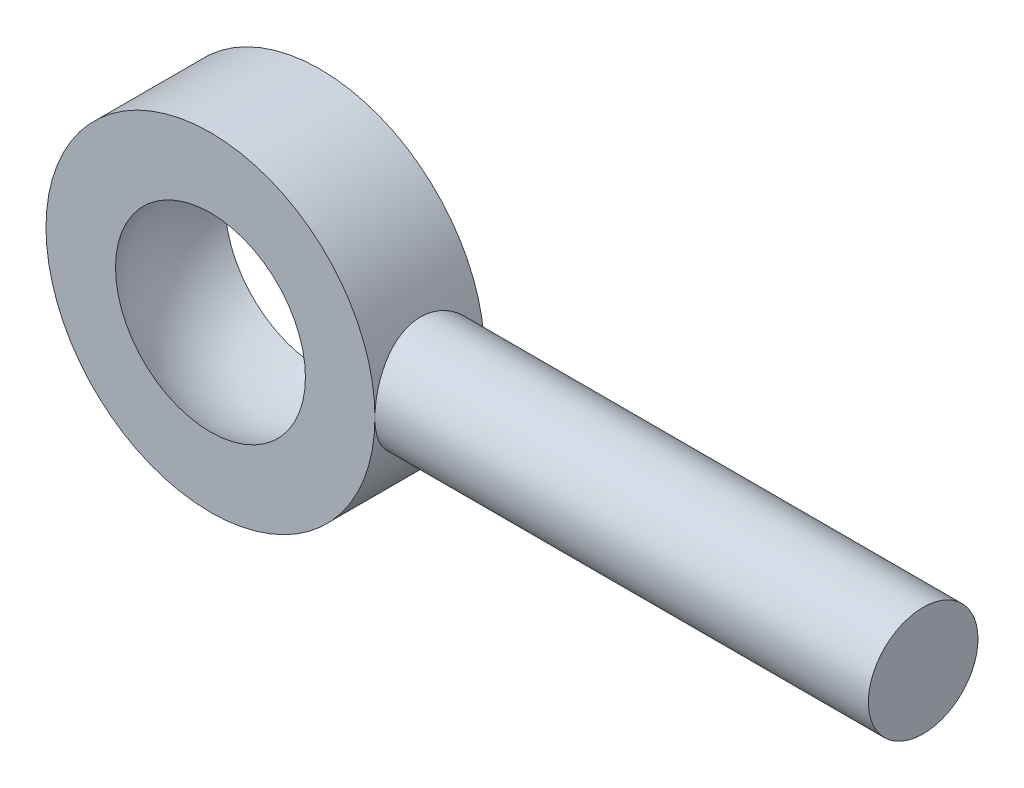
ISO-10303-21;
HEADER;
FILE_DESCRIPTION(('STEP AP214'),'2;1');
FILE_NAME('part.step','',(''),(''),'','','');
FILE_SCHEMA(('AUTOMOTIVE_DESIGN { 1 0 10303 214 1 1 1 1 }'));
ENDSEC;
DATA;
#1=APPLICATION_CONTEXT('core data for automotive mechanical design processes');
#2=APPLICATION_PROTOCOL_DEFINITION('international standard','automotive_design',2000,#1);
#3=PRODUCT_CONTEXT('',#1,'mechanical');
#4=PRODUCT('Part','Part','',(#3));
#5=PRODUCT_RELATED_PRODUCT_CATEGORY('part','',(#4));
#6=PRODUCT_DEFINITION_FORMATION('','',#4);
#7=PRODUCT_DEFINITION_CONTEXT('part definition',#1,'design');
#8=PRODUCT_DEFINITION('design','',#6,#7);
#9=PRODUCT_DEFINITION_SHAPE('','',#8);
#10=(LENGTH_UNIT() NAMED_UNIT(*) SI_UNIT(.MILLI.,.METRE.));
#11=(NAMED_UNIT(*) PLANE_ANGLE_UNIT() SI_UNIT($,.RADIAN.));
#12=(NAMED_UNIT(*) SI_UNIT($,.STERADIAN.) SOLID_ANGLE_UNIT());
#13=UNCERTAINTY_MEASURE_WITH_UNIT(LENGTH_MEASURE(1.E-05),#10,'distance_accuracy_value','');
#14=(GEOMETRIC_REPRESENTATION_CONTEXT(3) GLOBAL_UNCERTAINTY_ASSIGNED_CONTEXT((#13)) GLOBAL_UNIT_ASSIGNED_CONTEXT((#10,
#11,#12)) REPRESENTATION_CONTEXT('',''));
#15=CARTESIAN_POINT('',(0.,0.,0.));
#16=DIRECTION('',(0.,0.,1.));
#17=DIRECTION('',(1.,0.,0.));
#18=AXIS2_PLACEMENT_3D('',#15,#16,#17);
#19=CARTESIAN_POINT('',(-1.94289029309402E-13,0.,3.175));
#20=DIRECTION('',(0.,0.,-1.));
#21=DIRECTION('',(-1.,0.,0.));
#22=AXIS2_PLACEMENT_3D('',#19,#20,#21);
#23=CYLINDRICAL_SURFACE('',#22,9.525);
#24=CARTESIAN_POINT('',(9.52499999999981,0.,3.175));
#25=CARTESIAN_POINT('',(9.52500048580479,-0.173238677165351,3.17500080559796));
#26=CARTESIAN_POINT('',(9.52023018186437,-0.346472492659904,3.16077515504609));
#27=CARTESIAN_POINT('',(9.50167042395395,-0.687837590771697,3.10442257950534));
#28=CARTESIAN_POINT('',(9.4878800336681,-0.855968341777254,3.06229275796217));
#29=CARTESIAN_POINT('',(9.45277852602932,-1.18215660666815,2.95173640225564));
#30=CARTESIAN_POINT('',(9.4314799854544,-1.34023044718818,2.88335382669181));
#31=CARTESIAN_POINT('',(9.3835361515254,-1.64266542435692,2.72243177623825));
#32=CARTESIAN_POINT('',(9.35688980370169,-1.7870238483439,2.62988753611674));
#33=CARTESIAN_POINT('',(9.30002249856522,-2.06292981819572,2.41990306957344));
#34=CARTESIAN_POINT('',(9.26971591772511,-2.19393674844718,2.30177583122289));
#35=CARTESIAN_POINT('',(9.20941499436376,-2.43469379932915,2.04543928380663));
#36=CARTESIAN_POINT('',(9.17942072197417,-2.54443923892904,1.90722556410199));
#37=CARTESIAN_POINT('',(9.12219830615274,-2.74264419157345,1.60977225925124));
#38=CARTESIAN_POINT('',(9.09507449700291,-2.8304009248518,1.45004237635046));
#39=CARTESIAN_POINT('',(9.04796594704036,-2.97757492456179,1.11704090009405));
#40=CARTESIAN_POINT('',(9.02797902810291,-3.03700083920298,0.943773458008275));
#41=CARTESIAN_POINT('',(8.998308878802,-3.12379824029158,0.594762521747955));
#42=CARTESIAN_POINT('',(8.98830104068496,-3.15218269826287,0.419299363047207));
#43=CARTESIAN_POINT('',(8.97876209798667,-3.17925806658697,0.0658375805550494));
#44=CARTESIAN_POINT('',(8.97922775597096,-3.17795815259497,-0.112160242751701));
#45=CARTESIAN_POINT('',(8.99029872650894,-3.14648819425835,-0.456998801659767));
#46=CARTESIAN_POINT('',(9.00043970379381,-3.11764017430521,-0.623977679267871));
#47=CARTESIAN_POINT('',(9.02895888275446,-3.0340495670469,-0.950574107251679));
#48=CARTESIAN_POINT('',(9.04733807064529,-2.97930387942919,-1.11019077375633));
#49=CARTESIAN_POINT('',(9.09059367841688,-2.84460650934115,-1.42053547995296));
#50=CARTESIAN_POINT('',(9.11556996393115,-2.76426310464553,-1.57107898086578));
#51=CARTESIAN_POINT('',(9.16916373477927,-2.58092291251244,-1.85696513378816));
#52=CARTESIAN_POINT('',(9.19778227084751,-2.47791958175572,-1.99230337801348));
#53=CARTESIAN_POINT('',(9.25726270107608,-2.2458341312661,-2.25136582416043));
#54=CARTESIAN_POINT('',(9.28816371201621,-2.11567125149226,-2.3741148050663));
#55=CARTESIAN_POINT('',(9.34742029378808,-1.83622813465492,-2.59629677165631));
#56=CARTESIAN_POINT('',(9.37577562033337,-1.68694606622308,-2.69572752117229));
#57=CARTESIAN_POINT('',(9.42711817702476,-1.37143367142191,-2.86923575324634));
#58=CARTESIAN_POINT('',(9.45004936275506,-1.20504990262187,-2.94305193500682));
#59=CARTESIAN_POINT('',(9.4875530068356,-0.861279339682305,-3.06134507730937));
#60=CARTESIAN_POINT('',(9.50212836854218,-0.683896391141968,-3.10583222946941));
#61=CARTESIAN_POINT('',(9.520797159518,-0.33141865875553,-3.16247673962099));
#62=CARTESIAN_POINT('',(9.52531755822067,-0.156557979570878,-3.17595189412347));
#63=CARTESIAN_POINT('',(9.52464766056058,0.192960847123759,-3.17394376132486));
#64=CARTESIAN_POINT('',(9.51945900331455,0.367619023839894,-3.1584653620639));
#65=CARTESIAN_POINT('',(9.50023578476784,0.706500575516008,-3.10003219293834));
#66=CARTESIAN_POINT('',(9.48646180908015,0.870879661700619,-3.05788629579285));
#67=CARTESIAN_POINT('',(9.45171613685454,1.19016766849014,-2.94832581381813));
#68=CARTESIAN_POINT('',(9.43074352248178,1.34507537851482,-2.88090800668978));
#69=CARTESIAN_POINT('',(9.38304356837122,1.64556534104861,-2.72075137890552));
#70=CARTESIAN_POINT('',(9.35617936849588,1.79079512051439,-2.62739316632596));
#71=CARTESIAN_POINT('',(9.2997418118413,2.06395583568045,-2.41873357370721));
#72=CARTESIAN_POINT('',(9.27016762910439,2.19188146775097,-2.30342549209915));
#73=CARTESIAN_POINT('',(9.20993992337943,2.43285171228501,-2.04794246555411));
#74=CARTESIAN_POINT('',(9.17929841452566,2.54495607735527,-1.90687570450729));
#75=CARTESIAN_POINT('',(9.12177415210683,2.74401763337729,-1.6072752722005));
#76=CARTESIAN_POINT('',(9.09489142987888,2.83097461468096,-1.44874145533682));
#77=CARTESIAN_POINT('',(9.04819093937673,2.97687025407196,-1.11863817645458));
#78=CARTESIAN_POINT('',(9.02835890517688,3.03586556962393,-0.947095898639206));
#79=CARTESIAN_POINT('',(8.99829392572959,3.12386556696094,-0.595697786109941));
#80=CARTESIAN_POINT('',(8.98805665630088,3.15288375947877,-0.415845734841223));
#81=CARTESIAN_POINT('',(8.97883201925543,3.17905219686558,-0.0628742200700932));
#82=CARTESIAN_POINT('',(8.97929370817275,3.17776306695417,0.11011643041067));
#83=CARTESIAN_POINT('',(8.99005281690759,3.1471942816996,0.45327911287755));
#84=CARTESIAN_POINT('',(9.00034965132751,3.117916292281,0.623451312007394));
#85=CARTESIAN_POINT('',(9.02920864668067,3.03330550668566,0.952930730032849));
#86=CARTESIAN_POINT('',(9.04761011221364,2.97847812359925,1.1123829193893));
#87=CARTESIAN_POINT('',(9.09054566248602,2.84473448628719,1.41994701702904));
#88=CARTESIAN_POINT('',(9.11508110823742,2.76581288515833,1.56805639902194));
#89=CARTESIAN_POINT('',(9.16885482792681,2.58210269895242,1.85573565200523));
#90=CARTESIAN_POINT('',(9.19825159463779,2.47633567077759,1.99465089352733));
#91=CARTESIAN_POINT('',(9.25777156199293,2.24359115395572,2.2532651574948));
#92=CARTESIAN_POINT('',(9.28789496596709,2.11660766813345,2.37295872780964));
#93=CARTESIAN_POINT('',(9.34688346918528,1.83909194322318,2.59443350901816));
#94=CARTESIAN_POINT('',(9.37565377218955,1.68783480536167,2.69533480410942));
#95=CARTESIAN_POINT('',(9.42740021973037,1.36955960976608,2.87016961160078));
#96=CARTESIAN_POINT('',(9.4503778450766,1.20254559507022,2.94411001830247));
#97=CARTESIAN_POINT('',(9.48707510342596,0.865167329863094,3.05981618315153));
#98=CARTESIAN_POINT('',(9.50116249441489,0.6952861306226,3.10287183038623));
#99=CARTESIAN_POINT('',(9.52012342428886,0.35026732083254,3.16045939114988));
#100=CARTESIAN_POINT('',(9.52499950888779,0.175131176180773,3.1749991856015));
#101=CARTESIAN_POINT('',(9.52499999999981,0.,3.175));
#102=B_SPLINE_CURVE_WITH_KNOTS('',3,(#24,#25,#26,#27,#28,#29,#30,#31,#32,#33,#34,#35,#36,#37,
#38,#39,#40,#41,#42,#43,#44,#45,#46,#47,#48,#49,#50,#51,#52,#53,#54,#55,#56,#57,#58,#59,#60,#61,
#62,#63,#64,#65,#66,#67,#68,#69,#70,#71,#72,#73,#74,#75,#76,#77,#78,#79,#80,#81,#82,#83,#84,#85,
#86,#87,#88,#89,#90,#91,#92,#93,#94,#95,#96,#97,#98,#99,#100,#101),.UNSPECIFIED.,.T.,.F.,(4,2,2,
2,2,2,2,2,2,2,2,2,2,2,2,2,2,2,2,2,2,2,2,2,2,2,2,2,2,2,2,2,2,2,2,2,2,2,4),(0.,0.519071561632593,
1.03819701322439,1.55645698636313,2.07481924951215,2.60936372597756,3.14402575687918,
3.69406121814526,4.24392866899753,4.77526114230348,5.3064293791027,5.8133242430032,
6.32027980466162,6.83539943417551,7.35066800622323,7.892837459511,8.43505888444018,
8.98265937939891,9.53006948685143,10.0537512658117,10.5773446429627,11.0857715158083,
11.5942632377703,12.1161301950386,12.638156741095,13.1839024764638,13.7296527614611,
14.274292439,14.8186865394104,15.3351123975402,15.8515075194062,16.3580948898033,
16.8647947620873,17.3936046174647,17.9225642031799,18.4721392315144,19.0215736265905,
19.5464607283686,20.0712027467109),.UNSPECIFIED.);
#103=CARTESIAN_POINT('',(9.52499999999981,0.,3.175));
#104=VERTEX_POINT('',#103);
#105=CARTESIAN_POINT('',(9.52499999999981,0.,-3.175));
#106=VERTEX_POINT('',#105);
#107=EDGE_CURVE('E11',#104,#106,#102,.T.);
#108=ORIENTED_EDGE('',*,*,#107,.F.);
#109=CARTESIAN_POINT('',(-1.94289029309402E-13,0.,3.175));
#110=DIRECTION('',(0.,0.,1.));
#111=DIRECTION('',(1.,0.,0.));
#112=AXIS2_PLACEMENT_3D('',#109,#110,#111);
#113=CIRCLE('',#112,9.525);
#114=EDGE_CURVE('E56',#104,#104,#113,.T.);
#115=ORIENTED_EDGE('',*,*,#114,.F.);
#116=EDGE_CURVE('E36',#106,#104,#102,.T.);
#117=ORIENTED_EDGE('',*,*,#116,.F.);
#118=CARTESIAN_POINT('',(-1.94289029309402E-13,0.,-3.175));
#119=DIRECTION('',(0.,0.,1.));
#120=DIRECTION('',(1.,0.,0.));
#121=AXIS2_PLACEMENT_3D('',#118,#119,#120);
#122=CIRCLE('',#121,9.525);
#123=EDGE_CURVE('E58',#106,#106,#122,.T.);
#124=ORIENTED_EDGE('',*,*,#123,.T.);
#125=EDGE_LOOP('',(#108,#115,#117,#124));
#126=FACE_BOUND('',#125,.T.);
#127=ADVANCED_FACE('F32',(#126),#23,.T.);
#128=CARTESIAN_POINT('',(-1.94289029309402E-13,0.,3.175));
#129=DIRECTION('',(0.,0.,1.));
#130=DIRECTION('',(1.,0.,0.));
#131=AXIS2_PLACEMENT_3D('',#128,#129,#130);
#132=PLANE('',#131);
#133=ORIENTED_EDGE('',*,*,#114,.T.);
#134=EDGE_LOOP('',(#133));
#135=FACE_BOUND('',#134,.T.);
#136=CARTESIAN_POINT('',(-1.94289029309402E-13,0.,3.175));
#137=DIRECTION('',(0.,0.,1.));
#138=DIRECTION('',(1.,0.,0.));
#139=AXIS2_PLACEMENT_3D('',#136,#137,#138);
#140=CIRCLE('',#139,5.49926131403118);
#141=CARTESIAN_POINT('',(5.49926131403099,0.,3.175));
#142=VERTEX_POINT('',#141);
#143=EDGE_CURVE('E60',#142,#142,#140,.F.);
#144=ORIENTED_EDGE('',*,*,#143,.T.);
#145=EDGE_LOOP('',(#144));
#146=FACE_BOUND('',#145,.T.);
#147=ADVANCED_FACE('F88',(#135,#146),#132,.T.);
#148=CARTESIAN_POINT('',(-1.94289029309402E-13,0.,-3.175));
#149=DIRECTION('',(0.,0.,1.));
#150=DIRECTION('',(1.,0.,0.));
#151=AXIS2_PLACEMENT_3D('',#148,#149,#150);
#152=PLANE('',#151);
#153=ORIENTED_EDGE('',*,*,#123,.F.);
#154=EDGE_LOOP('',(#153));
#155=FACE_BOUND('',#154,.T.);
#156=CARTESIAN_POINT('',(-1.94289029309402E-13,0.,-3.175));
#157=DIRECTION('',(0.,0.,1.));
#158=DIRECTION('',(1.,0.,0.));
#159=AXIS2_PLACEMENT_3D('',#156,#157,#158);
#160=CIRCLE('',#159,5.49926131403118);
#161=CARTESIAN_POINT('',(5.49926131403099,0.,-3.175));
#162=VERTEX_POINT('',#161);
#163=EDGE_CURVE('E63',#162,#162,#160,.F.);
#164=ORIENTED_EDGE('',*,*,#163,.F.);
#165=EDGE_LOOP('',(#164));
#166=FACE_BOUND('',#165,.T.);
#167=ADVANCED_FACE('F84',(#155,#166),#152,.F.);
#168=CARTESIAN_POINT('',(-1.94289029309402E-13,0.,0.));
#169=DIRECTION('',(0.,0.,-1.));
#170=DIRECTION('',(1.,0.,0.));
#171=AXIS2_PLACEMENT_3D('',#168,#169,#170);
#172=SPHERICAL_SURFACE('',#171,6.35);
#173=CARTESIAN_POINT('',(6.34999999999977,0.,0.));
#174=VERTEX_POINT('',#173);
#175=VERTEX_LOOP('',#174);
#176=FACE_BOUND('',#175,.T.);
#177=ORIENTED_EDGE('',*,*,#143,.F.);
#178=EDGE_LOOP('',(#177));
#179=FACE_BOUND('',#178,.T.);
#180=ORIENTED_EDGE('',*,*,#163,.T.);
#181=EDGE_LOOP('',(#180));
#182=FACE_BOUND('',#181,.T.);
#183=ADVANCED_FACE('F78',(#176,#179,#182),#172,.F.);
#184=CARTESIAN_POINT('',(38.0999999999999,0.,0.));
#185=DIRECTION('',(-1.,0.,0.));
#186=DIRECTION('',(0.,0.,1.));
#187=AXIS2_PLACEMENT_3D('',#184,#185,#186);
#188=CYLINDRICAL_SURFACE('',#187,3.175);
#189=CARTESIAN_POINT('',(38.0999999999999,0.,0.));
#190=DIRECTION('',(1.,0.,0.));
#191=DIRECTION('',(0.,0.,-1.));
#192=AXIS2_PLACEMENT_3D('',#189,#190,#191);
#193=CIRCLE('',#192,3.175);
#194=CARTESIAN_POINT('',(38.0999999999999,0.,-3.175));
#195=VERTEX_POINT('',#194);
#196=EDGE_CURVE('E65',#195,#195,#193,.T.);
#197=ORIENTED_EDGE('',*,*,#196,.F.);
#198=EDGE_LOOP('',(#197));
#199=FACE_BOUND('',#198,.T.);
#200=ORIENTED_EDGE('',*,*,#116,.T.);
#201=ORIENTED_EDGE('',*,*,#107,.T.);
#202=EDGE_LOOP('',(#200,#201));
#203=FACE_BOUND('',#202,.T.);
#204=ADVANCED_FACE('F75',(#199,#203),#188,.T.);
#205=CARTESIAN_POINT('',(38.0999999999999,0.,0.));
#206=DIRECTION('',(1.,0.,0.));
#207=DIRECTION('',(0.,0.,-1.));
#208=AXIS2_PLACEMENT_3D('',#205,#206,#207);
#209=PLANE('',#208);
#210=ORIENTED_EDGE('',*,*,#196,.T.);
#211=EDGE_LOOP('',(#210));
#212=FACE_BOUND('',#211,.T.);
#213=ADVANCED_FACE('F73',(#212),#209,.T.);
#214=CLOSED_SHELL('',(#127,#147,#167,#183,#204,#213));
#215=MANIFOLD_SOLID_BREP('B2',#214);
#216=ADVANCED_BREP_SHAPE_REPRESENTATION('',(#18,#215),#14);
#217=SHAPE_DEFINITION_REPRESENTATION(#9,#216);
ENDSEC;
END-ISO-10303-21;
